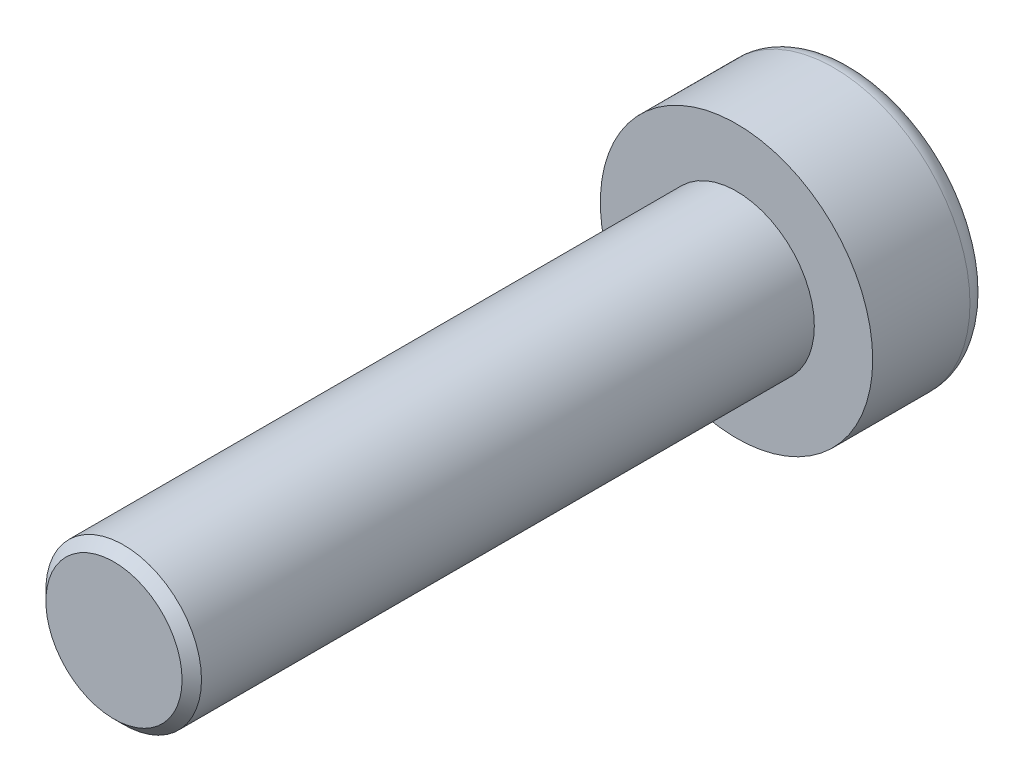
from build123d import *

# Parameters (mm, degrees)
ESQUISSE1_R          = 3.5
BASE_EXTRUSION_DEPTH = 3
ESQUISSE2_R          = 2
BOSS_EXTRU_1_DEPTH   = 16
CHANFREIN1_SIZE      = 0.25
CONG_1_R             = 0.5


with BuildPart() as part:
    # Esquisse1 → Base-Extrusion (new body)
    with BuildSketch(Plane.XY):
        Circle(ESQUISSE1_R)
    extrude(amount=BASE_EXTRUSION_DEPTH)

    # Esquisse2 → Boss.-Extru.1 (add)
    with BuildSketch(Plane.XY.offset(3)):
        Circle(ESQUISSE2_R)
    extrude(amount=BOSS_EXTRU_1_DEPTH)

    # Chanfrein1
    chanfrein1_edges = [part.edges().sort_by_distance(p)[0] for p in [
        (-2, 0, 19),
    ]]
    chamfer(chanfrein1_edges, length=CHANFREIN1_SIZE)

    # Cong_1
    cong_1_edges = [part.edges().sort_by_distance(p)[0] for p in [
        (-3.5, 0, 0),
    ]]
    fillet(cong_1_edges, radius=CONG_1_R)


solid = part.part
